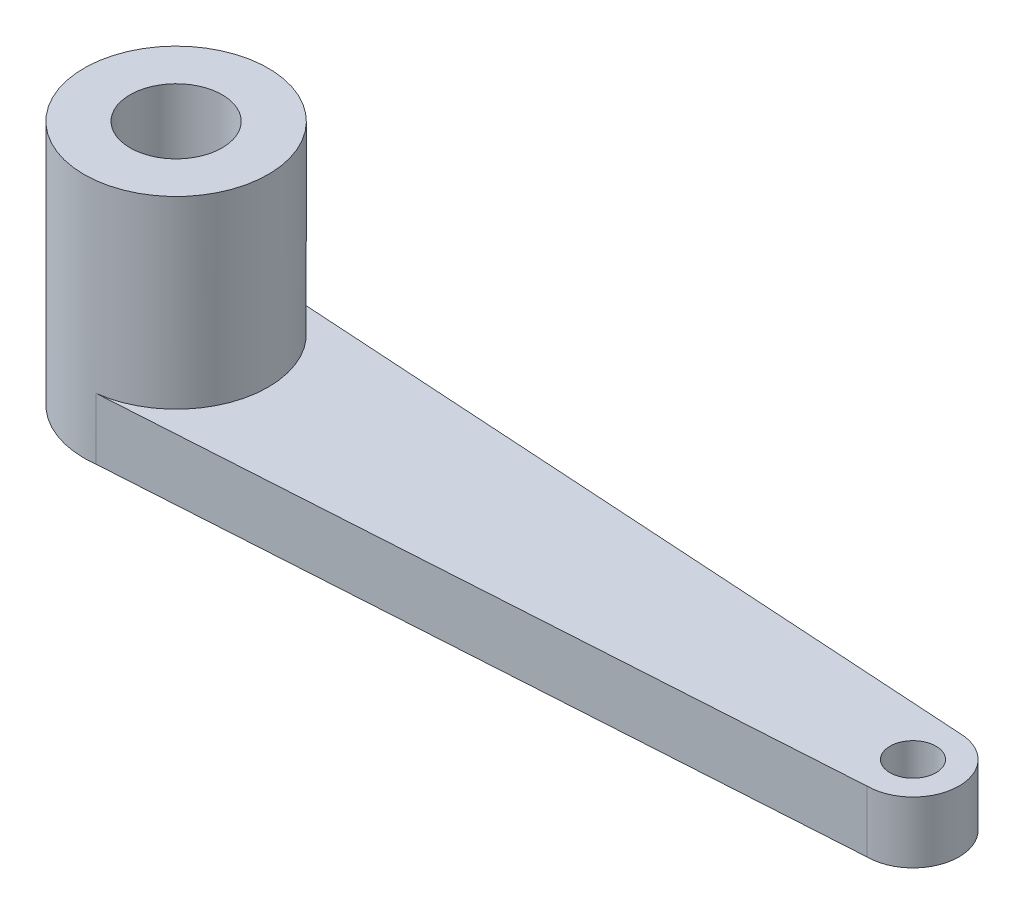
ISO-10303-21;
HEADER;
FILE_DESCRIPTION(('STEP AP214'),'2;1');
FILE_NAME('part.step','',(''),(''),'','','');
FILE_SCHEMA(('AUTOMOTIVE_DESIGN { 1 0 10303 214 1 1 1 1 }'));
ENDSEC;
DATA;
#1=APPLICATION_CONTEXT('core data for automotive mechanical design processes');
#2=APPLICATION_PROTOCOL_DEFINITION('international standard','automotive_design',2000,#1);
#3=PRODUCT_CONTEXT('',#1,'mechanical');
#4=PRODUCT('Part','Part','',(#3));
#5=PRODUCT_RELATED_PRODUCT_CATEGORY('part','',(#4));
#6=PRODUCT_DEFINITION_FORMATION('','',#4);
#7=PRODUCT_DEFINITION_CONTEXT('part definition',#1,'design');
#8=PRODUCT_DEFINITION('design','',#6,#7);
#9=PRODUCT_DEFINITION_SHAPE('','',#8);
#10=(LENGTH_UNIT() NAMED_UNIT(*) SI_UNIT(.MILLI.,.METRE.));
#11=(NAMED_UNIT(*) PLANE_ANGLE_UNIT() SI_UNIT($,.RADIAN.));
#12=(NAMED_UNIT(*) SI_UNIT($,.STERADIAN.) SOLID_ANGLE_UNIT());
#13=UNCERTAINTY_MEASURE_WITH_UNIT(LENGTH_MEASURE(1.E-05),#10,'distance_accuracy_value','');
#14=(GEOMETRIC_REPRESENTATION_CONTEXT(3) GLOBAL_UNCERTAINTY_ASSIGNED_CONTEXT((#13)) GLOBAL_UNIT_ASSIGNED_CONTEXT((#10,
#11,#12)) REPRESENTATION_CONTEXT('',''));
#15=CARTESIAN_POINT('',(0.,0.,0.));
#16=DIRECTION('',(0.,0.,1.));
#17=DIRECTION('',(1.,0.,0.));
#18=AXIS2_PLACEMENT_3D('',#15,#16,#17);
#19=CARTESIAN_POINT('',(0.,0.,0.));
#20=DIRECTION('',(0.,1.,0.));
#21=DIRECTION('',(0.,0.,1.));
#22=AXIS2_PLACEMENT_3D('',#19,#20,#21);
#23=PLANE('',#22);
#24=CARTESIAN_POINT('',(25.4,0.,0.));
#25=DIRECTION('',(0.,-1.,0.));
#26=DIRECTION('',(0.,0.,-1.));
#27=AXIS2_PLACEMENT_3D('',#24,#25,#26);
#28=CIRCLE('',#27,0.793749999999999);
#29=CARTESIAN_POINT('',(25.4,0.,-0.793749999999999));
#30=VERTEX_POINT('',#29);
#31=EDGE_CURVE('E196',#30,#30,#28,.T.);
#32=ORIENTED_EDGE('',*,*,#31,.F.);
#33=EDGE_LOOP('',(#32));
#34=FACE_BOUND('',#33,.T.);
#35=CARTESIAN_POINT('',(0.,0.,0.));
#36=DIRECTION('',(0.,1.,0.));
#37=DIRECTION('',(0.,0.,1.));
#38=AXIS2_PLACEMENT_3D('',#35,#36,#37);
#39=CIRCLE('',#38,1.5875);
#40=CARTESIAN_POINT('',(0.,0.,1.5875));
#41=VERTEX_POINT('',#40);
#42=EDGE_CURVE('E107',#41,#41,#39,.T.);
#43=ORIENTED_EDGE('',*,*,#42,.T.);
#44=EDGE_LOOP('',(#43));
#45=FACE_BOUND('',#44,.T.);
#46=CARTESIAN_POINT('',(0.,0.,0.));
#47=DIRECTION('',(0.,1.,0.));
#48=DIRECTION('',(0.,0.,1.));
#49=AXIS2_PLACEMENT_3D('',#46,#47,#48);
#50=CIRCLE('',#49,3.175);
#51=CARTESIAN_POINT('',(0.,0.,-3.175));
#52=VERTEX_POINT('',#51);
#53=CARTESIAN_POINT('',(0.,0.,3.175));
#54=VERTEX_POINT('',#53);
#55=EDGE_CURVE('E121',#52,#54,#50,.T.);
#56=ORIENTED_EDGE('',*,*,#55,.F.);
#57=CARTESIAN_POINT('',(0.,0.,0.));
#58=DIRECTION('',(0.,1.,0.));
#59=DIRECTION('',(0.124513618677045,0.,-0.992217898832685));
#60=AXIS2_PLACEMENT_3D('',#57,#58,#59);
#61=CIRCLE('',#60,3.175);
#62=CARTESIAN_POINT('',(0.395330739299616,0.,-3.15029182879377));
#63=VERTEX_POINT('',#62);
#64=EDGE_CURVE('E135',#63,#52,#61,.T.);
#65=ORIENTED_EDGE('',*,*,#64,.F.);
#66=DIRECTION('',(0.998052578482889,0.,0.0623782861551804));
#67=VECTOR('',#66,1.);
#68=CARTESIAN_POINT('',(0.,0.,-3.175));
#69=LINE('',#68,#67);
#70=CARTESIAN_POINT('',(25.4,0.,-1.5875));
#71=VERTEX_POINT('',#70);
#72=EDGE_CURVE('E110',#63,#71,#69,.T.);
#73=ORIENTED_EDGE('',*,*,#72,.T.);
#74=CARTESIAN_POINT('',(25.4,0.,0.));
#75=DIRECTION('',(0.,-1.,0.));
#76=DIRECTION('',(0.,0.,-1.));
#77=AXIS2_PLACEMENT_3D('',#74,#75,#76);
#78=CIRCLE('',#77,1.5875);
#79=CARTESIAN_POINT('',(25.4,0.,1.5875));
#80=VERTEX_POINT('',#79);
#81=EDGE_CURVE('E97',#71,#80,#78,.T.);
#82=ORIENTED_EDGE('',*,*,#81,.T.);
#83=DIRECTION('',(-0.998052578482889,0.,0.0623782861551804));
#84=VECTOR('',#83,1.);
#85=CARTESIAN_POINT('',(0.,0.,3.175));
#86=LINE('',#85,#84);
#87=CARTESIAN_POINT('',(0.395330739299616,0.,3.15029182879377));
#88=VERTEX_POINT('',#87);
#89=EDGE_CURVE('E90',#80,#88,#86,.T.);
#90=ORIENTED_EDGE('',*,*,#89,.T.);
#91=CARTESIAN_POINT('',(0.,0.,0.));
#92=DIRECTION('',(0.,1.,0.));
#93=DIRECTION('',(0.,0.,1.));
#94=AXIS2_PLACEMENT_3D('',#91,#92,#93);
#95=CIRCLE('',#94,3.175);
#96=EDGE_CURVE('E43',#54,#88,#95,.T.);
#97=ORIENTED_EDGE('',*,*,#96,.F.);
#98=EDGE_LOOP('',(#56,#65,#73,#82,#90,#97));
#99=FACE_BOUND('',#98,.T.);
#100=ADVANCED_FACE('F33',(#34,#45,#99),#23,.F.);
#101=CARTESIAN_POINT('',(0.,8.46666666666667,0.));
#102=DIRECTION('',(0.,-1.,0.));
#103=DIRECTION('',(0.,0.,-1.));
#104=AXIS2_PLACEMENT_3D('',#101,#102,#103);
#105=CYLINDRICAL_SURFACE('',#104,3.175);
#106=CARTESIAN_POINT('',(0.,2.116666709,0.));
#107=DIRECTION('',(0.,-1.,0.));
#108=DIRECTION('',(0.,0.,-1.));
#109=AXIS2_PLACEMENT_3D('',#106,#107,#108);
#110=CIRCLE('',#109,3.175);
#111=CARTESIAN_POINT('',(0.395330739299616,2.116666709,-3.15029182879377));
#112=VERTEX_POINT('',#111);
#113=CARTESIAN_POINT('',(0.395330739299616,2.116666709,3.15029182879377));
#114=VERTEX_POINT('',#113);
#115=EDGE_CURVE('E11',#112,#114,#110,.T.);
#116=ORIENTED_EDGE('',*,*,#115,.F.);
#117=DIRECTION('',(0.,-1.,0.));
#118=VECTOR('',#117,1.);
#119=CARTESIAN_POINT('',(0.395330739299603,8.46666666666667,-3.15029182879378));
#120=LINE('',#119,#118);
#121=EDGE_CURVE('E86',#112,#63,#120,.T.);
#122=ORIENTED_EDGE('',*,*,#121,.T.);
#123=ORIENTED_EDGE('',*,*,#64,.T.);
#124=ORIENTED_EDGE('',*,*,#55,.T.);
#125=ORIENTED_EDGE('',*,*,#96,.T.);
#126=DIRECTION('',(0.,-1.,0.));
#127=VECTOR('',#126,1.);
#128=CARTESIAN_POINT('',(0.395330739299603,8.46666666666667,3.15029182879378));
#129=LINE('',#128,#127);
#130=EDGE_CURVE('E51',#88,#114,#129,.F.);
#131=ORIENTED_EDGE('',*,*,#130,.T.);
#132=EDGE_LOOP('',(#116,#122,#123,#124,#125,#131));
#133=FACE_BOUND('',#132,.T.);
#134=CARTESIAN_POINT('',(0.,8.46666666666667,0.));
#135=DIRECTION('',(0.,1.,0.));
#136=DIRECTION('',(0.,0.,1.));
#137=AXIS2_PLACEMENT_3D('',#134,#135,#136);
#138=CIRCLE('',#137,3.175);
#139=CARTESIAN_POINT('',(0.,8.46666666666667,3.175));
#140=VERTEX_POINT('',#139);
#141=EDGE_CURVE('E132',#140,#140,#138,.T.);
#142=ORIENTED_EDGE('',*,*,#141,.F.);
#143=EDGE_LOOP('',(#142));
#144=FACE_BOUND('',#143,.T.);
#145=ADVANCED_FACE('F35',(#133,#144),#105,.T.);
#146=CARTESIAN_POINT('',(0.,8.46666666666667,0.));
#147=DIRECTION('',(0.,1.,0.));
#148=DIRECTION('',(0.,0.,1.));
#149=AXIS2_PLACEMENT_3D('',#146,#147,#148);
#150=PLANE('',#149);
#151=CARTESIAN_POINT('',(0.,8.46666666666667,0.));
#152=DIRECTION('',(0.,1.,0.));
#153=DIRECTION('',(0.,0.,1.));
#154=AXIS2_PLACEMENT_3D('',#151,#152,#153);
#155=CIRCLE('',#154,1.5875);
#156=CARTESIAN_POINT('',(0.,8.46666666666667,1.5875));
#157=VERTEX_POINT('',#156);
#158=EDGE_CURVE('E199',#157,#157,#155,.T.);
#159=ORIENTED_EDGE('',*,*,#158,.F.);
#160=EDGE_LOOP('',(#159));
#161=FACE_BOUND('',#160,.T.);
#162=ORIENTED_EDGE('',*,*,#141,.T.);
#163=EDGE_LOOP('',(#162));
#164=FACE_BOUND('',#163,.T.);
#165=ADVANCED_FACE('F168',(#161,#164),#150,.T.);
#166=CARTESIAN_POINT('',(25.4,2.116666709,0.));
#167=DIRECTION('',(0.,-1.,0.));
#168=DIRECTION('',(0.,0.,-1.));
#169=AXIS2_PLACEMENT_3D('',#166,#167,#168);
#170=PLANE('',#169);
#171=CARTESIAN_POINT('',(25.4,2.116666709,0.));
#172=DIRECTION('',(0.,-1.,0.));
#173=DIRECTION('',(0.,0.,-1.));
#174=AXIS2_PLACEMENT_3D('',#171,#172,#173);
#175=CIRCLE('',#174,0.793749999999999);
#176=CARTESIAN_POINT('',(25.4,2.116666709,-0.793749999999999));
#177=VERTEX_POINT('',#176);
#178=EDGE_CURVE('E38',#177,#177,#175,.T.);
#179=ORIENTED_EDGE('',*,*,#178,.T.);
#180=EDGE_LOOP('',(#179));
#181=FACE_BOUND('',#180,.T.);
#182=DIRECTION('',(0.998052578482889,0.,0.0623782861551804));
#183=VECTOR('',#182,1.);
#184=CARTESIAN_POINT('',(0.,2.116666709,-3.175));
#185=LINE('',#184,#183);
#186=CARTESIAN_POINT('',(25.4,2.116666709,-1.5875));
#187=VERTEX_POINT('',#186);
#188=EDGE_CURVE('E80',#112,#187,#185,.T.);
#189=ORIENTED_EDGE('',*,*,#188,.F.);
#190=ORIENTED_EDGE('',*,*,#115,.T.);
#191=DIRECTION('',(-0.998052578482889,0.,0.0623782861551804));
#192=VECTOR('',#191,1.);
#193=CARTESIAN_POINT('',(0.,2.116666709,3.175));
#194=LINE('',#193,#192);
#195=CARTESIAN_POINT('',(25.4,2.116666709,1.5875));
#196=VERTEX_POINT('',#195);
#197=EDGE_CURVE('E99',#196,#114,#194,.T.);
#198=ORIENTED_EDGE('',*,*,#197,.F.);
#199=CARTESIAN_POINT('',(25.4,2.116666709,0.));
#200=DIRECTION('',(0.,-1.,0.));
#201=DIRECTION('',(0.,0.,-1.));
#202=AXIS2_PLACEMENT_3D('',#199,#200,#201);
#203=CIRCLE('',#202,1.5875);
#204=EDGE_CURVE('E89',#187,#196,#203,.T.);
#205=ORIENTED_EDGE('',*,*,#204,.F.);
#206=EDGE_LOOP('',(#189,#190,#198,#205));
#207=FACE_BOUND('',#206,.T.);
#208=ADVANCED_FACE('F101',(#181,#207),#170,.F.);
#209=CARTESIAN_POINT('',(0.,2.116666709,3.175));
#210=DIRECTION('',(0.0623782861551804,0.,0.998052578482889));
#211=DIRECTION('',(0.998052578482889,0.,-0.0623782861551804));
#212=AXIS2_PLACEMENT_3D('',#209,#210,#211);
#213=PLANE('',#212);
#214=ORIENTED_EDGE('',*,*,#130,.F.);
#215=ORIENTED_EDGE('',*,*,#89,.F.);
#216=DIRECTION('',(0.,-1.,0.));
#217=VECTOR('',#216,1.);
#218=CARTESIAN_POINT('',(25.4,2.116666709,1.5875));
#219=LINE('',#218,#217);
#220=EDGE_CURVE('E98',#196,#80,#219,.T.);
#221=ORIENTED_EDGE('',*,*,#220,.F.);
#222=ORIENTED_EDGE('',*,*,#197,.T.);
#223=EDGE_LOOP('',(#214,#215,#221,#222));
#224=FACE_BOUND('',#223,.T.);
#225=ADVANCED_FACE('F175',(#224),#213,.T.);
#226=CARTESIAN_POINT('',(0.,2.116666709,-3.175));
#227=DIRECTION('',(0.0623782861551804,0.,-0.998052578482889));
#228=DIRECTION('',(-0.998052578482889,0.,-0.0623782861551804));
#229=AXIS2_PLACEMENT_3D('',#226,#227,#228);
#230=PLANE('',#229);
#231=ORIENTED_EDGE('',*,*,#121,.F.);
#232=ORIENTED_EDGE('',*,*,#188,.T.);
#233=DIRECTION('',(0.,-1.,0.));
#234=VECTOR('',#233,1.);
#235=CARTESIAN_POINT('',(25.4,2.116666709,-1.5875));
#236=LINE('',#235,#234);
#237=EDGE_CURVE('E84',#187,#71,#236,.T.);
#238=ORIENTED_EDGE('',*,*,#237,.T.);
#239=ORIENTED_EDGE('',*,*,#72,.F.);
#240=EDGE_LOOP('',(#231,#232,#238,#239));
#241=FACE_BOUND('',#240,.T.);
#242=ADVANCED_FACE('F82',(#241),#230,.T.);
#243=CARTESIAN_POINT('',(25.4,2.116666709,0.));
#244=DIRECTION('',(0.,-1.,0.));
#245=DIRECTION('',(0.,0.,-1.));
#246=AXIS2_PLACEMENT_3D('',#243,#244,#245);
#247=CYLINDRICAL_SURFACE('',#246,1.5875);
#248=ORIENTED_EDGE('',*,*,#81,.F.);
#249=ORIENTED_EDGE('',*,*,#237,.F.);
#250=ORIENTED_EDGE('',*,*,#204,.T.);
#251=ORIENTED_EDGE('',*,*,#220,.T.);
#252=EDGE_LOOP('',(#248,#249,#250,#251));
#253=FACE_BOUND('',#252,.T.);
#254=ADVANCED_FACE('F94',(#253),#247,.T.);
#255=CARTESIAN_POINT('',(0.,-0.0463690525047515,0.));
#256=DIRECTION('',(0.,1.,0.));
#257=DIRECTION('',(0.,0.,1.));
#258=AXIS2_PLACEMENT_3D('',#255,#256,#257);
#259=CYLINDRICAL_SURFACE('',#258,1.5875);
#260=ORIENTED_EDGE('',*,*,#158,.T.);
#261=EDGE_LOOP('',(#260));
#262=FACE_BOUND('',#261,.T.);
#263=ORIENTED_EDGE('',*,*,#42,.F.);
#264=EDGE_LOOP('',(#263));
#265=FACE_BOUND('',#264,.T.);
#266=ADVANCED_FACE('F178',(#262,#265),#259,.F.);
#267=CARTESIAN_POINT('',(25.4,8.46666666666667,0.));
#268=DIRECTION('',(0.,-1.,0.));
#269=DIRECTION('',(0.,0.,-1.));
#270=AXIS2_PLACEMENT_3D('',#267,#268,#269);
#271=CYLINDRICAL_SURFACE('',#270,0.793749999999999);
#272=ORIENTED_EDGE('',*,*,#31,.T.);
#273=EDGE_LOOP('',(#272));
#274=FACE_BOUND('',#273,.T.);
#275=ORIENTED_EDGE('',*,*,#178,.F.);
#276=EDGE_LOOP('',(#275));
#277=FACE_BOUND('',#276,.T.);
#278=ADVANCED_FACE('F187',(#274,#277),#271,.F.);
#279=CLOSED_SHELL('',(#100,#145,#165,#208,#225,#242,#254,#266,#278));
#280=MANIFOLD_SOLID_BREP('B2',#279);
#281=ADVANCED_BREP_SHAPE_REPRESENTATION('',(#18,#280),#14);
#282=SHAPE_DEFINITION_REPRESENTATION(#9,#281);
ENDSEC;
END-ISO-10303-21;
